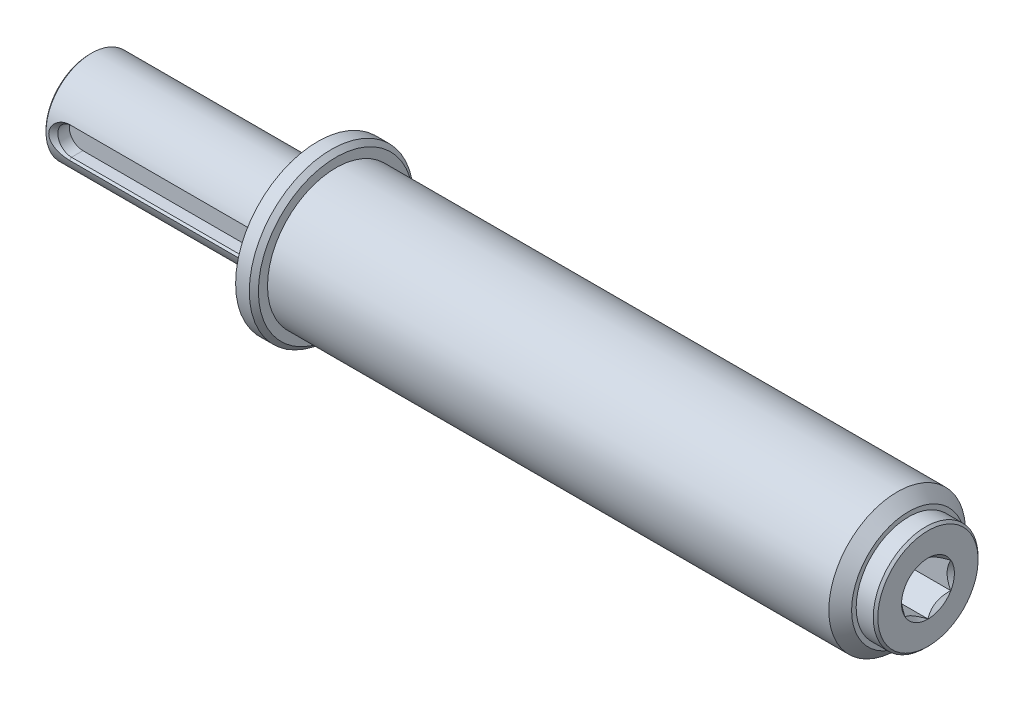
from build123d import *

# Parameters (mm, degrees)
LINEAR_AUSTRAGEN1_DEPTH      = 19.55
LINEAR_AUSTRAGEN1_DEPTH_BACK = 19.55
LINEAR_AUSTRAGEN2_DEPTH      = 10


with BuildPart() as part:
    # Skizze1 → Rotation1 (revolve)
    with BuildSketch(Plane.XY, mode=Mode.PRIVATE) as rotation1_sk:
        Polygon((-50, 0), (-50, 9.6), (-49.6, 10), (0, 10), (0, 18), (3, 18), (4, 17), (4, 15), (127.15, 15), (129.65, 12.5), (129.65, 11.5), (133.4, 11.5), (133.9, 11), (133.9, 5.8), (133.1, 5), (123.9, 5), (123.9, 0), align=None)
    revolve(rotation1_sk.sketch.rotate(Axis((123.9, 0, 0), (-1, 0, 0)), 270), axis=Axis((123.9, 0, 0), (-1, 0, 0)))

    # Skizze2 → Linear austragen1 (cut, two sides: drawn at the far end of the back side and taken through both)
    with BuildSketch(Plane(origin=(-25.45, 0, 0), x_dir=(0, 0, -1), z_dir=(1, 0, 0)).offset(-LINEAR_AUSTRAGEN1_DEPTH_BACK)):
        Polygon((-10.414213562, 4.414213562), (-10.414213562, -4.414213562), (-9, -3), (-6.5, -3), (-6.5, 3), (-9, 3), align=None)
    extrude(amount=LINEAR_AUSTRAGEN1_DEPTH + LINEAR_AUSTRAGEN1_DEPTH_BACK, mode=Mode.SUBTRACT)

    # Skizze3 → Schnitt-Rotation1 (revolve, cut)
    with BuildSketch(Plane(origin=(-5.9, 0, 0), x_dir=(0, 0, -1), z_dir=(1, 0, 0))):
        Polygon((-10.414213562, 0), (-10.414213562, 4.414213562), (-9, 3), (-6.5, 3), (-6.5, 0), align=None)
    revolve(axis=Axis((-5.9, 0, 6.5), (0, 0, 1)), mode=Mode.SUBTRACT)

    # Skizze4 → Schnitt-Rotation2 (revolve, cut)
    with BuildSketch(Plane(origin=(-45, 0, 0), x_dir=(0, 0, -1), z_dir=(1, 0, 0))):
        Polygon((-10.414213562, 0), (-10.414213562, 4.414213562), (-9, 3), (-6.5, 3), (-6.5, 0), align=None)
    revolve(axis=Axis((-45, 0, 6.5), (0, 0, 1)), mode=Mode.SUBTRACT)

    # Skizze5 → Linear austragen2 (cut)
    with BuildSketch(Plane(origin=(133.9, 0, 0), x_dir=(0, 0, -1), z_dir=(1, 0, 0))):
        Polygon((-5, 2.886751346), (-5, -2.886751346), (0, -5.773502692), (5, -2.886751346), (5, 2.886751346), (0, 5.773502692), align=None)
    extrude(amount=-LINEAR_AUSTRAGEN2_DEPTH, mode=Mode.SUBTRACT)

    # Skizze6 → Schnitt-Rotation3 (revolve, cut)
    with BuildSketch(Plane.XY, mode=Mode.PRIVATE) as schnitt_rotation3_sk:
        Polygon((-50, 0), (-50, 4.8), (-47.2, 3.2), (-45, 3.2), (-44.2585, 2.4585), (-29, 2.4585), (-27.580584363, 0), align=None)
    revolve(schnitt_rotation3_sk.sketch.rotate(Axis((-27.580584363, 0, 0), (-1, 0, 0)), 270), axis=Axis((-27.580584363, 0, 0), (-1, 0, 0)), mode=Mode.SUBTRACT)

    # Skizze7 → Schnitt-Rotation4 (revolve, cut)
    with BuildSketch(Plane.XY, mode=Mode.PRIVATE) as schnitt_rotation4_sk:
        Polygon((109.480584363, 0), (110.9, 2.4585), (122.432664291, 2.4585), (123.9, 5), (123.9, 0), align=None)
    revolve(schnitt_rotation4_sk.sketch.rotate(Axis((123.9, 0, 0), (-1, 0, 0)), 270), axis=Axis((123.9, 0, 0), (-1, 0, 0)), mode=Mode.SUBTRACT)


solid = part.part
